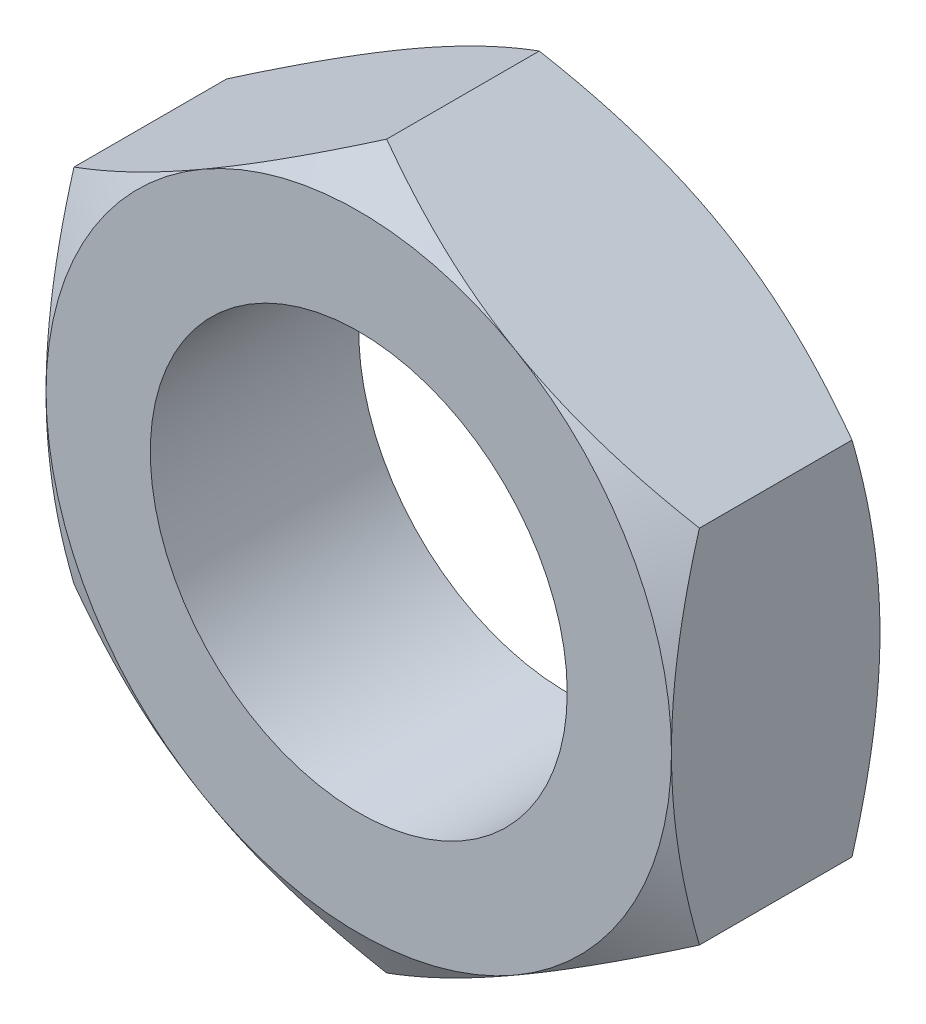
ISO-10303-21;
HEADER;
FILE_DESCRIPTION(('STEP AP214'),'2;1');
FILE_NAME('part.step','',(''),(''),'','','');
FILE_SCHEMA(('AUTOMOTIVE_DESIGN { 1 0 10303 214 1 1 1 1 }'));
ENDSEC;
DATA;
#1=APPLICATION_CONTEXT('core data for automotive mechanical design processes');
#2=APPLICATION_PROTOCOL_DEFINITION('international standard','automotive_design',2000,#1);
#3=PRODUCT_CONTEXT('',#1,'mechanical');
#4=PRODUCT('Part','Part','',(#3));
#5=PRODUCT_RELATED_PRODUCT_CATEGORY('part','',(#4));
#6=PRODUCT_DEFINITION_FORMATION('','',#4);
#7=PRODUCT_DEFINITION_CONTEXT('part definition',#1,'design');
#8=PRODUCT_DEFINITION('design','',#6,#7);
#9=PRODUCT_DEFINITION_SHAPE('','',#8);
#10=(LENGTH_UNIT() NAMED_UNIT(*) SI_UNIT(.MILLI.,.METRE.));
#11=(NAMED_UNIT(*) PLANE_ANGLE_UNIT() SI_UNIT($,.RADIAN.));
#12=(NAMED_UNIT(*) SI_UNIT($,.STERADIAN.) SOLID_ANGLE_UNIT());
#13=UNCERTAINTY_MEASURE_WITH_UNIT(LENGTH_MEASURE(1.E-05),#10,'distance_accuracy_value','');
#14=(GEOMETRIC_REPRESENTATION_CONTEXT(3) GLOBAL_UNCERTAINTY_ASSIGNED_CONTEXT((#13)) GLOBAL_UNIT_ASSIGNED_CONTEXT((#10,
#11,#12)) REPRESENTATION_CONTEXT('',''));
#15=CARTESIAN_POINT('',(0.,0.,0.));
#16=DIRECTION('',(0.,0.,1.));
#17=DIRECTION('',(1.,0.,0.));
#18=AXIS2_PLACEMENT_3D('',#15,#16,#17);
#19=CARTESIAN_POINT('',(-10.5,18.1865334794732,0.));
#20=DIRECTION('',(0.,0.,-1.));
#21=DIRECTION('',(-1.,0.,0.));
#22=AXIS2_PLACEMENT_3D('',#19,#20,#21);
#23=PLANE('',#22);
#24=CARTESIAN_POINT('',(0.,0.,0.));
#25=DIRECTION('',(0.,0.,1.));
#26=DIRECTION('',(1.,0.,0.));
#27=AXIS2_PLACEMENT_3D('',#24,#25,#26);
#28=CIRCLE('',#27,7.);
#29=CARTESIAN_POINT('',(7.,0.,0.));
#30=VERTEX_POINT('',#29);
#31=EDGE_CURVE('E320',#30,#30,#28,.T.);
#32=ORIENTED_EDGE('',*,*,#31,.F.);
#33=EDGE_LOOP('',(#32));
#34=FACE_BOUND('',#33,.T.);
#35=CARTESIAN_POINT('',(0.,0.,0.));
#36=DIRECTION('',(0.,0.,-1.));
#37=DIRECTION('',(-1.,0.,0.));
#38=AXIS2_PLACEMENT_3D('',#35,#36,#37);
#39=CIRCLE('',#38,10.5);
#40=CARTESIAN_POINT('',(-10.5,0.,0.));
#41=VERTEX_POINT('',#40);
#42=CARTESIAN_POINT('',(-5.25,9.09326673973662,0.));
#43=VERTEX_POINT('',#42);
#44=EDGE_CURVE('E328',#41,#43,#39,.T.);
#45=ORIENTED_EDGE('',*,*,#44,.F.);
#46=CARTESIAN_POINT('',(0.,0.,0.));
#47=DIRECTION('',(0.,0.,-1.));
#48=DIRECTION('',(-1.,0.,0.));
#49=AXIS2_PLACEMENT_3D('',#46,#47,#48);
#50=CIRCLE('',#49,10.5);
#51=CARTESIAN_POINT('',(-5.24999999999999,-9.09326673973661,0.));
#52=VERTEX_POINT('',#51);
#53=EDGE_CURVE('E151',#41,#52,#50,.F.);
#54=ORIENTED_EDGE('',*,*,#53,.T.);
#55=CARTESIAN_POINT('',(5.24999999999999,-9.09326673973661,0.));
#56=VERTEX_POINT('',#55);
#57=EDGE_CURVE('E252',#52,#56,#50,.F.);
#58=ORIENTED_EDGE('',*,*,#57,.T.);
#59=CARTESIAN_POINT('',(10.5,0.,0.));
#60=VERTEX_POINT('',#59);
#61=EDGE_CURVE('E154',#56,#60,#50,.F.);
#62=ORIENTED_EDGE('',*,*,#61,.T.);
#63=CARTESIAN_POINT('',(5.24999999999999,9.09326673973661,0.));
#64=VERTEX_POINT('',#63);
#65=EDGE_CURVE('E129',#60,#64,#50,.F.);
#66=ORIENTED_EDGE('',*,*,#65,.T.);
#67=EDGE_CURVE('E142',#64,#43,#50,.F.);
#68=ORIENTED_EDGE('',*,*,#67,.T.);
#69=EDGE_LOOP('',(#45,#54,#58,#62,#66,#68));
#70=FACE_BOUND('',#69,.T.);
#71=ADVANCED_FACE('F34',(#34,#70),#23,.F.);
#72=CARTESIAN_POINT('',(0.,0.,0.));
#73=DIRECTION('',(0.,0.,-1.));
#74=DIRECTION('',(-1.,0.,0.));
#75=AXIS2_PLACEMENT_3D('',#72,#73,#74);
#76=CONICAL_SURFACE('',#75,10.5,1.0471975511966);
#77=CARTESIAN_POINT('',(-10.5,-16.4358944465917,-5.19820443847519));
#78=CARTESIAN_POINT('',(-10.5,-16.2059572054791,-5.08633284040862));
#79=CARTESIAN_POINT('',(-10.5,-15.9757542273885,-4.97500768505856));
#80=CARTESIAN_POINT('',(-10.5,-15.5147613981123,-4.75357372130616));
#81=CARTESIAN_POINT('',(-10.5,-15.2839715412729,-4.64346492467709));
#82=CARTESIAN_POINT('',(-10.5,-14.5905791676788,-4.31512021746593));
#83=CARTESIAN_POINT('',(-10.5,-14.1270195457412,-4.0988980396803));
#84=CARTESIAN_POINT('',(-10.5,-13.1943979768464,-3.67197063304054));
#85=CARTESIAN_POINT('',(-10.5,-12.7253199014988,-3.46130055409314));
#86=CARTESIAN_POINT('',(-10.5,-11.7834863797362,-3.04837704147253));
#87=CARTESIAN_POINT('',(-10.5,-11.3107311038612,-2.84612322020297));
#88=CARTESIAN_POINT('',(-10.5,-10.3449331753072,-2.44567902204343));
#89=CARTESIAN_POINT('',(-10.5,-9.85174008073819,-2.24784963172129));
#90=CARTESIAN_POINT('',(-10.5,-8.85963681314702,-1.86679740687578));
#91=CARTESIAN_POINT('',(-10.5,-8.36072601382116,-1.68357619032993));
#92=CARTESIAN_POINT('',(-10.5,-7.35729528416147,-1.33644217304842));
#93=CARTESIAN_POINT('',(-10.5,-6.85278853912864,-1.1724915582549));
#94=CARTESIAN_POINT('',(-10.5,-5.83649208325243,-0.869048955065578));
#95=CARTESIAN_POINT('',(-10.5,-5.32470467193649,-0.729549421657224));
#96=CARTESIAN_POINT('',(-10.5,-4.55289136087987,-0.543995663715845));
#97=CARTESIAN_POINT('',(-10.5,-4.29566635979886,-0.486224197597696));
#98=CARTESIAN_POINT('',(-10.5,-3.77943107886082,-0.379252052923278));
#99=CARTESIAN_POINT('',(-10.5,-3.52042083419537,-0.330051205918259));
#100=CARTESIAN_POINT('',(-10.5,-3.00078262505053,-0.241079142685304));
#101=CARTESIAN_POINT('',(-10.5,-2.74015469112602,-0.201307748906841));
#102=CARTESIAN_POINT('',(-10.5,-2.21754460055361,-0.131981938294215));
#103=CARTESIAN_POINT('',(-10.5,-1.95556249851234,-0.102427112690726));
#104=CARTESIAN_POINT('',(-10.5,-1.4340966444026,-0.0545007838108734));
#105=CARTESIAN_POINT('',(-10.5,-1.1746262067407,-0.0359853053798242));
#106=CARTESIAN_POINT('',(-10.5,-0.655134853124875,-0.00995108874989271));
#107=CARTESIAN_POINT('',(-10.5,-0.39511394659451,-0.00243216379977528));
#108=CARTESIAN_POINT('',(-10.5,0.12501291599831,0.00142934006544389));
#109=CARTESIAN_POINT('',(-10.5,0.385118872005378,-0.00222807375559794));
#110=CARTESIAN_POINT('',(-10.5,0.904941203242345,-0.0206279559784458));
#111=CARTESIAN_POINT('',(-10.5,1.16465755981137,-0.0353709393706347));
#112=CARTESIAN_POINT('',(-10.5,1.7842910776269,-0.0834532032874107));
#113=CARTESIAN_POINT('',(-10.5,2.14382833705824,-0.121799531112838));
#114=CARTESIAN_POINT('',(-10.5,2.86031645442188,-0.217678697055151));
#115=CARTESIAN_POINT('',(-10.5,3.21726697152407,-0.27521401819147));
#116=CARTESIAN_POINT('',(-10.5,4.28378552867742,-0.473559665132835));
#117=CARTESIAN_POINT('',(-10.5,4.98864074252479,-0.640076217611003));
#118=CARTESIAN_POINT('',(-10.5,6.04276689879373,-0.929878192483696));
#119=CARTESIAN_POINT('',(-10.5,6.39747786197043,-1.03452367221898));
#120=CARTESIAN_POINT('',(-10.5,7.10345747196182,-1.25494800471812));
#121=CARTESIAN_POINT('',(-10.5,7.45472609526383,-1.37072693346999));
#122=CARTESIAN_POINT('',(-10.5,8.1539260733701,-1.61153872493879));
#123=CARTESIAN_POINT('',(-10.5,8.50185842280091,-1.73656872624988));
#124=CARTESIAN_POINT('',(-10.5,9.19482306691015,-1.99438530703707));
#125=CARTESIAN_POINT('',(-10.5,9.53985540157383,-2.12717177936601));
#126=CARTESIAN_POINT('',(-10.5,10.376454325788,-2.45822492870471));
#127=CARTESIAN_POINT('',(-10.5,10.8666655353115,-2.6599111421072));
#128=CARTESIAN_POINT('',(-10.5,11.8427074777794,-3.07365042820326));
#129=CARTESIAN_POINT('',(-10.5,12.3285378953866,-3.28570424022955));
#130=CARTESIAN_POINT('',(-10.5,13.2966698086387,-3.7180282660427));
#131=CARTESIAN_POINT('',(-10.5,13.7789703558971,-3.93830059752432));
#132=CARTESIAN_POINT('',(-10.5,14.7405285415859,-4.38534134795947));
#133=CARTESIAN_POINT('',(-10.5,15.2197862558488,-4.61210960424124));
#134=CARTESIAN_POINT('',(-10.5,16.1763649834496,-5.07116576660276));
#135=CARTESIAN_POINT('',(-10.5,16.6536829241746,-5.30346006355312));
#136=CARTESIAN_POINT('',(-10.5,17.6062110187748,-5.77233035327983));
#137=CARTESIAN_POINT('',(-10.5,18.0814211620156,-6.00890636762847));
#138=CARTESIAN_POINT('',(-10.5,19.0299973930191,-6.48554777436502));
#139=CARTESIAN_POINT('',(-10.5,19.5033637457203,-6.72561264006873));
#140=CARTESIAN_POINT('',(-10.5,20.4485969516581,-7.20867815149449));
#141=CARTESIAN_POINT('',(-10.5,20.92046379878,-7.45167880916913));
#142=CARTESIAN_POINT('',(-10.5,22.2507580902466,-8.14113674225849));
#143=CARTESIAN_POINT('',(-10.5,23.1077085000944,-8.59044374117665));
#144=CARTESIAN_POINT('',(-10.5,24.8184449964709,-9.49511172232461));
#145=CARTESIAN_POINT('',(-10.5,25.6722309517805,-9.95047295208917));
#146=CARTESIAN_POINT('',(-10.5,27.3750010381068,-10.8645542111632));
#147=CARTESIAN_POINT('',(-10.5,28.223991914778,-11.3232616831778));
#148=CARTESIAN_POINT('',(-10.5,29.4959967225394,-12.0139868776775));
#149=CARTESIAN_POINT('',(-10.5,29.9197387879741,-12.2446656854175));
#150=CARTESIAN_POINT('',(-10.5,30.7667866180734,-12.706821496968));
#151=CARTESIAN_POINT('',(-10.5,31.1900923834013,-12.9382984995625));
#152=CARTESIAN_POINT('',(-10.5,31.6132051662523,-13.1701278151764));
#153=B_SPLINE_CURVE_WITH_KNOTS('',3,(#77,#78,#79,#80,#81,#82,#83,#84,#85,#86,#87,#88,#89,#90,
#91,#92,#93,#94,#95,#96,#97,#98,#99,#100,#101,#102,#103,#104,#105,#106,#107,#108,#109,#110,#111,
#112,#113,#114,#115,#116,#117,#118,#119,#120,#121,#122,#123,#124,#125,#126,#127,#128,#129,#130,
#131,#132,#133,#134,#135,#136,#137,#138,#139,#140,#141,#142,#143,#144,#145,#146,#147,#148,#149,
#150,#151,#152),.UNSPECIFIED.,.F.,.F.,(4,2,2,2,2,2,2,2,2,2,2,2,2,2,2,2,2,2,2,2,2,2,2,2,2,2,2,2,
2,2,2,2,2,2,2,2,2,4),(0.,0.767121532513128,1.53425048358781,3.06872766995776,4.61130541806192,
6.15381204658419,7.74780690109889,9.34197805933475,10.9329668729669,12.5234638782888,
13.3142425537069,14.1050056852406,14.8957539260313,15.686470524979,16.4666352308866,
17.2467866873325,18.0269376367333,18.8071248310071,19.8912444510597,20.9755044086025,
23.1451630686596,24.2545416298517,25.3639277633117,26.4729721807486,27.5820012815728,
29.1720757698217,30.7622638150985,32.3528644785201,33.9434253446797,35.5359249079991,
37.1284324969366,38.7207021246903,40.312978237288,43.215727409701,46.1185956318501,
49.013541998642,50.4609288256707,51.9083134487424),.UNSPECIFIED.);
#154=CARTESIAN_POINT('',(-10.5,6.06217782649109,-0.937822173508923));
#155=VERTEX_POINT('',#154);
#156=EDGE_CURVE('E159',#155,#41,#153,.F.);
#157=ORIENTED_EDGE('',*,*,#156,.T.);
#158=ORIENTED_EDGE('',*,*,#44,.T.);
#159=CARTESIAN_POINT('',(0.000200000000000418,12.124471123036,-0.937888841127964));
#160=CARTESIAN_POINT('',(-0.230612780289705,11.9912113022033,-0.86096391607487));
#161=CARTESIAN_POINT('',(-0.462286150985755,11.8574546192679,-0.787530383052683));
#162=CARTESIAN_POINT('',(-0.927490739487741,11.588868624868,-0.648614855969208));
#163=CARTESIAN_POINT('',(-1.16102254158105,11.4540389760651,-0.583135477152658));
#164=CARTESIAN_POINT('',(-1.86538084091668,11.0473775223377,-0.399895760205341));
#165=CARTESIAN_POINT('',(-2.33898788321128,10.7739403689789,-0.295669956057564));
#166=CARTESIAN_POINT('',(-3.04771913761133,10.3647541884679,-0.173455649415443));
#167=CARTESIAN_POINT('',(-3.28072597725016,10.2302276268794,-0.138641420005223));
#168=CARTESIAN_POINT('',(-3.74781845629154,9.96055165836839,-0.0802602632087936));
#169=CARTESIAN_POINT('',(-3.98190411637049,9.82540223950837,-0.0566935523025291));
#170=CARTESIAN_POINT('',(-4.45046590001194,9.55487796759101,-0.0214112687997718));
#171=CARTESIAN_POINT('',(-4.68494122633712,9.41950357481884,-0.00968161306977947));
#172=CARTESIAN_POINT('',(-5.15410845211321,9.14862975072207,0.0016773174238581));
#173=CARTESIAN_POINT('',(-5.38880034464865,9.01313032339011,0.00130696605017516));
#174=CARTESIAN_POINT('',(-5.82756124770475,8.75981159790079,-0.0106922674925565));
#175=CARTESIAN_POINT('',(-6.03166122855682,8.64197441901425,-0.0208573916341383));
#176=CARTESIAN_POINT('',(-6.43938384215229,8.40657565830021,-0.0501416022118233));
#177=CARTESIAN_POINT('',(-6.64300644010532,8.28901409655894,-0.0692613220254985));
#178=CARTESIAN_POINT('',(-7.25308524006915,7.93678493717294,-0.139600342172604));
#179=CARTESIAN_POINT('',(-7.65846156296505,7.70274080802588,-0.203790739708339));
#180=CARTESIAN_POINT('',(-8.47351422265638,7.23216993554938,-0.364267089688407));
#181=CARTESIAN_POINT('',(-8.88308654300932,6.99570324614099,-0.461233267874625));
#182=CARTESIAN_POINT('',(-9.69612354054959,6.52629611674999,-0.681306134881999));
#183=CARTESIAN_POINT('',(-10.0995986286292,6.29334966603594,-0.80436113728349));
#184=CARTESIAN_POINT('',(-10.5002,6.06206235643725,-0.937888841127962));
#185=B_SPLINE_CURVE_WITH_KNOTS('',3,(#159,#160,#161,#162,#163,#164,#165,#166,#167,#168,#169,
#170,#171,#172,#173,#174,#175,#176,#177,#178,#179,#180,#181,#182,#183,#184),.UNSPECIFIED.,.F.,
.F.,(4,2,2,2,2,2,2,2,2,2,2,2,4),(0.,0.832130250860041,1.66453336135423,3.33288308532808,
4.14658222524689,4.9602970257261,5.77304256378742,6.58576298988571,7.29326708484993,
8.00082123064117,9.41693497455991,10.864454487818,12.3091325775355),.UNSPECIFIED.);
#186=EDGE_CURVE('E191',#43,#155,#185,.T.);
#187=ORIENTED_EDGE('',*,*,#186,.T.);
#188=EDGE_LOOP('',(#157,#158,#187));
#189=FACE_BOUND('',#188,.T.);
#190=ADVANCED_FACE('F178',(#189),#76,.T.);
#191=CARTESIAN_POINT('',(10.5002,6.06206235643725,-0.937888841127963));
#192=CARTESIAN_POINT('',(10.2693872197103,6.19532217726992,-0.860963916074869));
#193=CARTESIAN_POINT('',(10.0377138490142,6.32907886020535,-0.787530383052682));
#194=CARTESIAN_POINT('',(9.57250926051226,6.59766485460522,-0.648614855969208));
#195=CARTESIAN_POINT('',(9.33897745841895,6.73249450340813,-0.583135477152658));
#196=CARTESIAN_POINT('',(8.63461915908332,7.13915595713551,-0.399895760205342));
#197=CARTESIAN_POINT('',(8.16101211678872,7.41259311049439,-0.295669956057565));
#198=CARTESIAN_POINT('',(7.45228086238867,7.82177929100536,-0.173455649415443));
#199=CARTESIAN_POINT('',(7.21927402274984,7.95630585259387,-0.138641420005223));
#200=CARTESIAN_POINT('',(6.75218154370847,8.22598182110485,-0.0802602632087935));
#201=CARTESIAN_POINT('',(6.51809588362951,8.36113123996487,-0.0566935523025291));
#202=CARTESIAN_POINT('',(6.04953409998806,8.63165551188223,-0.0214112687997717));
#203=CARTESIAN_POINT('',(5.81505877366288,8.7670299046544,-0.00968161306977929));
#204=CARTESIAN_POINT('',(5.34589154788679,9.03790372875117,0.00167731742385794));
#205=CARTESIAN_POINT('',(5.11119965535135,9.17340315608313,0.00130696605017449));
#206=CARTESIAN_POINT('',(4.67243875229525,9.42672188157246,-0.0106922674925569));
#207=CARTESIAN_POINT('',(4.46833877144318,9.54455906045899,-0.020857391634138));
#208=CARTESIAN_POINT('',(4.06061615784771,9.77995782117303,-0.0501416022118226));
#209=CARTESIAN_POINT('',(3.85699355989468,9.89751938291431,-0.0692613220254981));
#210=CARTESIAN_POINT('',(3.24691475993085,10.2497485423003,-0.139600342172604));
#211=CARTESIAN_POINT('',(2.84153843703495,10.4837926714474,-0.203790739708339));
#212=CARTESIAN_POINT('',(2.02648577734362,10.9543635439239,-0.364267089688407));
#213=CARTESIAN_POINT('',(1.61691345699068,11.1908302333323,-0.461233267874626));
#214=CARTESIAN_POINT('',(0.803876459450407,11.6602373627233,-0.681306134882));
#215=CARTESIAN_POINT('',(0.400401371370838,11.8931838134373,-0.804361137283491));
#216=CARTESIAN_POINT('',(-0.000199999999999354,12.124471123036,-0.937888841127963));
#217=B_SPLINE_CURVE_WITH_KNOTS('',3,(#191,#192,#193,#194,#195,#196,#197,#198,#199,#200,#201,
#202,#203,#204,#205,#206,#207,#208,#209,#210,#211,#212,#213,#214,#215,#216),.UNSPECIFIED.,.F.,
.F.,(4,2,2,2,2,2,2,2,2,2,2,2,4),(0.,0.83213025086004,1.66453336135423,3.33288308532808,
4.14658222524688,4.9602970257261,5.77304256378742,6.58576298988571,7.29326708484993,
8.00082123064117,9.41693497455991,10.864454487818,12.3091325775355),.UNSPECIFIED.);
#218=CARTESIAN_POINT('',(0.,12.1243556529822,-0.937822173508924));
#219=VERTEX_POINT('',#218);
#220=EDGE_CURVE('E138',#64,#219,#217,.T.);
#221=ORIENTED_EDGE('',*,*,#220,.T.);
#222=EDGE_CURVE('E145',#219,#43,#185,.T.);
#223=ORIENTED_EDGE('',*,*,#222,.T.);
#224=ORIENTED_EDGE('',*,*,#67,.F.);
#225=EDGE_LOOP('',(#221,#223,#224));
#226=FACE_BOUND('',#225,.T.);
#227=ADVANCED_FACE('F143',(#226),#76,.T.);
#228=CARTESIAN_POINT('',(10.5,-16.4358944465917,-5.19820443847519));
#229=CARTESIAN_POINT('',(10.5,-16.2059572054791,-5.08633284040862));
#230=CARTESIAN_POINT('',(10.5,-15.9757542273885,-4.97500768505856));
#231=CARTESIAN_POINT('',(10.5,-15.5147613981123,-4.75357372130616));
#232=CARTESIAN_POINT('',(10.5,-15.2839715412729,-4.64346492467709));
#233=CARTESIAN_POINT('',(10.5,-14.5905791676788,-4.31512021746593));
#234=CARTESIAN_POINT('',(10.5,-14.1270195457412,-4.0988980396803));
#235=CARTESIAN_POINT('',(10.5,-13.1943979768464,-3.67197063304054));
#236=CARTESIAN_POINT('',(10.5,-12.7253199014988,-3.46130055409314));
#237=CARTESIAN_POINT('',(10.5,-11.7834863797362,-3.04837704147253));
#238=CARTESIAN_POINT('',(10.5,-11.3107311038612,-2.84612322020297));
#239=CARTESIAN_POINT('',(10.5,-10.3449331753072,-2.44567902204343));
#240=CARTESIAN_POINT('',(10.5,-9.85174008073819,-2.24784963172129));
#241=CARTESIAN_POINT('',(10.5,-8.85963681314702,-1.86679740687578));
#242=CARTESIAN_POINT('',(10.5,-8.36072601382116,-1.68357619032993));
#243=CARTESIAN_POINT('',(10.5,-7.35729528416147,-1.33644217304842));
#244=CARTESIAN_POINT('',(10.5,-6.85278853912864,-1.1724915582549));
#245=CARTESIAN_POINT('',(10.5,-5.83649208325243,-0.869048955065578));
#246=CARTESIAN_POINT('',(10.5,-5.32470467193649,-0.729549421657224));
#247=CARTESIAN_POINT('',(10.5,-4.55289136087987,-0.543995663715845));
#248=CARTESIAN_POINT('',(10.5,-4.29566635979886,-0.486224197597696));
#249=CARTESIAN_POINT('',(10.5,-3.77943107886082,-0.379252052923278));
#250=CARTESIAN_POINT('',(10.5,-3.52042083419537,-0.330051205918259));
#251=CARTESIAN_POINT('',(10.5,-3.00078262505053,-0.241079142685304));
#252=CARTESIAN_POINT('',(10.5,-2.74015469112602,-0.201307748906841));
#253=CARTESIAN_POINT('',(10.5,-2.21754460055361,-0.131981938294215));
#254=CARTESIAN_POINT('',(10.5,-1.95556249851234,-0.102427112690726));
#255=CARTESIAN_POINT('',(10.5,-1.4340966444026,-0.0545007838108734));
#256=CARTESIAN_POINT('',(10.5,-1.1746262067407,-0.0359853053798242));
#257=CARTESIAN_POINT('',(10.5,-0.655134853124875,-0.00995108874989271));
#258=CARTESIAN_POINT('',(10.5,-0.39511394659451,-0.00243216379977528));
#259=CARTESIAN_POINT('',(10.5,0.12501291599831,0.00142934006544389));
#260=CARTESIAN_POINT('',(10.5,0.385118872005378,-0.00222807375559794));
#261=CARTESIAN_POINT('',(10.5,0.904941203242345,-0.0206279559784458));
#262=CARTESIAN_POINT('',(10.5,1.16465755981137,-0.0353709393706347));
#263=CARTESIAN_POINT('',(10.5,1.7842910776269,-0.0834532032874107));
#264=CARTESIAN_POINT('',(10.5,2.14382833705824,-0.121799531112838));
#265=CARTESIAN_POINT('',(10.5,2.86031645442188,-0.217678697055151));
#266=CARTESIAN_POINT('',(10.5,3.21726697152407,-0.27521401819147));
#267=CARTESIAN_POINT('',(10.5,4.28378552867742,-0.473559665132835));
#268=CARTESIAN_POINT('',(10.5,4.98864074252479,-0.640076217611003));
#269=CARTESIAN_POINT('',(10.5,6.04276689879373,-0.929878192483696));
#270=CARTESIAN_POINT('',(10.5,6.39747786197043,-1.03452367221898));
#271=CARTESIAN_POINT('',(10.5,7.10345747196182,-1.25494800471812));
#272=CARTESIAN_POINT('',(10.5,7.45472609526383,-1.37072693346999));
#273=CARTESIAN_POINT('',(10.5,8.1539260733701,-1.61153872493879));
#274=CARTESIAN_POINT('',(10.5,8.50185842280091,-1.73656872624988));
#275=CARTESIAN_POINT('',(10.5,9.19482306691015,-1.99438530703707));
#276=CARTESIAN_POINT('',(10.5,9.53985540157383,-2.12717177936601));
#277=CARTESIAN_POINT('',(10.5,10.376454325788,-2.45822492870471));
#278=CARTESIAN_POINT('',(10.5,10.8666655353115,-2.6599111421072));
#279=CARTESIAN_POINT('',(10.5,11.8427074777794,-3.07365042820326));
#280=CARTESIAN_POINT('',(10.5,12.3285378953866,-3.28570424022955));
#281=CARTESIAN_POINT('',(10.5,13.2966698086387,-3.7180282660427));
#282=CARTESIAN_POINT('',(10.5,13.7789703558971,-3.93830059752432));
#283=CARTESIAN_POINT('',(10.5,14.7405285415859,-4.38534134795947));
#284=CARTESIAN_POINT('',(10.5,15.2197862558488,-4.61210960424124));
#285=CARTESIAN_POINT('',(10.5,16.1763649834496,-5.07116576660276));
#286=CARTESIAN_POINT('',(10.5,16.6536829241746,-5.30346006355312));
#287=CARTESIAN_POINT('',(10.5,17.6062110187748,-5.77233035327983));
#288=CARTESIAN_POINT('',(10.5,18.0814211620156,-6.00890636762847));
#289=CARTESIAN_POINT('',(10.5,19.0299973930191,-6.48554777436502));
#290=CARTESIAN_POINT('',(10.5,19.5033637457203,-6.72561264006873));
#291=CARTESIAN_POINT('',(10.5,20.4485969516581,-7.20867815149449));
#292=CARTESIAN_POINT('',(10.5,20.92046379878,-7.45167880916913));
#293=CARTESIAN_POINT('',(10.5,22.2507580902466,-8.14113674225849));
#294=CARTESIAN_POINT('',(10.5,23.1077085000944,-8.59044374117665));
#295=CARTESIAN_POINT('',(10.5,24.8184449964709,-9.49511172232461));
#296=CARTESIAN_POINT('',(10.5,25.6722309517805,-9.95047295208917));
#297=CARTESIAN_POINT('',(10.5,27.3750010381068,-10.8645542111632));
#298=CARTESIAN_POINT('',(10.5,28.223991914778,-11.3232616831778));
#299=CARTESIAN_POINT('',(10.5,29.4959967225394,-12.0139868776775));
#300=CARTESIAN_POINT('',(10.5,29.9197387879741,-12.2446656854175));
#301=CARTESIAN_POINT('',(10.5,30.7667866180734,-12.706821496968));
#302=CARTESIAN_POINT('',(10.5,31.1900923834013,-12.9382984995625));
#303=CARTESIAN_POINT('',(10.5,31.6132051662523,-13.1701278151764));
#304=B_SPLINE_CURVE_WITH_KNOTS('',3,(#228,#229,#230,#231,#232,#233,#234,#235,#236,#237,#238,
#239,#240,#241,#242,#243,#244,#245,#246,#247,#248,#249,#250,#251,#252,#253,#254,#255,#256,#257,
#258,#259,#260,#261,#262,#263,#264,#265,#266,#267,#268,#269,#270,#271,#272,#273,#274,#275,#276,
#277,#278,#279,#280,#281,#282,#283,#284,#285,#286,#287,#288,#289,#290,#291,#292,#293,#294,#295,
#296,#297,#298,#299,#300,#301,#302,#303),.UNSPECIFIED.,.F.,.F.,(4,2,2,2,2,2,2,2,2,2,2,2,2,2,2,2,
2,2,2,2,2,2,2,2,2,2,2,2,2,2,2,2,2,2,2,2,2,4),(0.,0.767121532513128,1.53425048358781,
3.06872766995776,4.61130541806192,6.15381204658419,7.74780690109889,9.34197805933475,
10.9329668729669,12.5234638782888,13.3142425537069,14.1050056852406,14.8957539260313,
15.686470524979,16.4666352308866,17.2467866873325,18.0269376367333,18.8071248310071,
19.8912444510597,20.9755044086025,23.1451630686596,24.2545416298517,25.3639277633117,
26.4729721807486,27.5820012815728,29.1720757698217,30.7622638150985,32.3528644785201,
33.9434253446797,35.5359249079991,37.1284324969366,38.7207021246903,40.312978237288,
43.215727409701,46.1185956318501,49.013541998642,50.4609288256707,51.9083134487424),.UNSPECIFIED.);
#305=CARTESIAN_POINT('',(10.5,6.06217782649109,-0.937822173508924));
#306=VERTEX_POINT('',#305);
#307=EDGE_CURVE('E132',#60,#306,#304,.T.);
#308=ORIENTED_EDGE('',*,*,#307,.T.);
#309=EDGE_CURVE('E125',#306,#64,#217,.T.);
#310=ORIENTED_EDGE('',*,*,#309,.T.);
#311=ORIENTED_EDGE('',*,*,#65,.F.);
#312=EDGE_LOOP('',(#308,#310,#311));
#313=FACE_BOUND('',#312,.T.);
#314=ADVANCED_FACE('F127',(#313),#76,.T.);
#315=CARTESIAN_POINT('',(-0.000200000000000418,-12.124471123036,-0.937888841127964));
#316=CARTESIAN_POINT('',(0.230612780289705,-11.9912113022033,-0.86096391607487));
#317=CARTESIAN_POINT('',(0.462286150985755,-11.8574546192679,-0.787530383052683));
#318=CARTESIAN_POINT('',(0.927490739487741,-11.588868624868,-0.648614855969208));
#319=CARTESIAN_POINT('',(1.16102254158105,-11.4540389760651,-0.583135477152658));
#320=CARTESIAN_POINT('',(1.86538084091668,-11.0473775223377,-0.399895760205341));
#321=CARTESIAN_POINT('',(2.33898788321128,-10.7739403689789,-0.295669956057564));
#322=CARTESIAN_POINT('',(3.04771913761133,-10.3647541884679,-0.173455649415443));
#323=CARTESIAN_POINT('',(3.28072597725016,-10.2302276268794,-0.138641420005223));
#324=CARTESIAN_POINT('',(3.74781845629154,-9.96055165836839,-0.0802602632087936));
#325=CARTESIAN_POINT('',(3.98190411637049,-9.82540223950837,-0.0566935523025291));
#326=CARTESIAN_POINT('',(4.45046590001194,-9.55487796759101,-0.0214112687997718));
#327=CARTESIAN_POINT('',(4.68494122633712,-9.41950357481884,-0.00968161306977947));
#328=CARTESIAN_POINT('',(5.15410845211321,-9.14862975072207,0.0016773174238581));
#329=CARTESIAN_POINT('',(5.38880034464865,-9.01313032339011,0.00130696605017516));
#330=CARTESIAN_POINT('',(5.82756124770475,-8.75981159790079,-0.0106922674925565));
#331=CARTESIAN_POINT('',(6.03166122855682,-8.64197441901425,-0.0208573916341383));
#332=CARTESIAN_POINT('',(6.43938384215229,-8.40657565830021,-0.0501416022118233));
#333=CARTESIAN_POINT('',(6.64300644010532,-8.28901409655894,-0.0692613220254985));
#334=CARTESIAN_POINT('',(7.25308524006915,-7.93678493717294,-0.139600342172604));
#335=CARTESIAN_POINT('',(7.65846156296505,-7.70274080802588,-0.203790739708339));
#336=CARTESIAN_POINT('',(8.47351422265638,-7.23216993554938,-0.364267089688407));
#337=CARTESIAN_POINT('',(8.88308654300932,-6.99570324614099,-0.461233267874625));
#338=CARTESIAN_POINT('',(9.69612354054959,-6.52629611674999,-0.681306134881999));
#339=CARTESIAN_POINT('',(10.0995986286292,-6.29334966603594,-0.80436113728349));
#340=CARTESIAN_POINT('',(10.5002,-6.06206235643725,-0.937888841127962));
#341=B_SPLINE_CURVE_WITH_KNOTS('',3,(#315,#316,#317,#318,#319,#320,#321,#322,#323,#324,#325,
#326,#327,#328,#329,#330,#331,#332,#333,#334,#335,#336,#337,#338,#339,#340),.UNSPECIFIED.,.F.,
.F.,(4,2,2,2,2,2,2,2,2,2,2,2,4),(0.,0.832130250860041,1.66453336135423,3.33288308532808,
4.14658222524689,4.9602970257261,5.77304256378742,6.58576298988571,7.29326708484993,
8.00082123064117,9.41693497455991,10.864454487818,12.3091325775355),.UNSPECIFIED.);
#342=CARTESIAN_POINT('',(10.5,-6.06217782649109,-0.937822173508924));
#343=VERTEX_POINT('',#342);
#344=EDGE_CURVE('E205',#56,#343,#341,.T.);
#345=ORIENTED_EDGE('',*,*,#344,.T.);
#346=EDGE_CURVE('E204',#343,#60,#304,.T.);
#347=ORIENTED_EDGE('',*,*,#346,.T.);
#348=ORIENTED_EDGE('',*,*,#61,.F.);
#349=EDGE_LOOP('',(#345,#347,#348));
#350=FACE_BOUND('',#349,.T.);
#351=ADVANCED_FACE('F429',(#350),#76,.T.);
#352=CARTESIAN_POINT('',(0.,-12.1243556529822,-0.937822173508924));
#353=VERTEX_POINT('',#352);
#354=EDGE_CURVE('E262',#353,#56,#341,.T.);
#355=ORIENTED_EDGE('',*,*,#354,.T.);
#356=ORIENTED_EDGE('',*,*,#57,.F.);
#357=CARTESIAN_POINT('',(-10.5002,-6.06206235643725,-0.937888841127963));
#358=CARTESIAN_POINT('',(-10.2693872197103,-6.19532217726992,-0.860963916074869));
#359=CARTESIAN_POINT('',(-10.0377138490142,-6.32907886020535,-0.787530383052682));
#360=CARTESIAN_POINT('',(-9.57250926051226,-6.59766485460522,-0.648614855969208));
#361=CARTESIAN_POINT('',(-9.33897745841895,-6.73249450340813,-0.583135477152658));
#362=CARTESIAN_POINT('',(-8.63461915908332,-7.13915595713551,-0.399895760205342));
#363=CARTESIAN_POINT('',(-8.16101211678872,-7.41259311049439,-0.295669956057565));
#364=CARTESIAN_POINT('',(-7.45228086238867,-7.82177929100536,-0.173455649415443));
#365=CARTESIAN_POINT('',(-7.21927402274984,-7.95630585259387,-0.138641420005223));
#366=CARTESIAN_POINT('',(-6.75218154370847,-8.22598182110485,-0.0802602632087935));
#367=CARTESIAN_POINT('',(-6.51809588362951,-8.36113123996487,-0.0566935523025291));
#368=CARTESIAN_POINT('',(-6.04953409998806,-8.63165551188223,-0.0214112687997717));
#369=CARTESIAN_POINT('',(-5.81505877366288,-8.7670299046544,-0.00968161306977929));
#370=CARTESIAN_POINT('',(-5.34589154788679,-9.03790372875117,0.00167731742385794));
#371=CARTESIAN_POINT('',(-5.11119965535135,-9.17340315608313,0.00130696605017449));
#372=CARTESIAN_POINT('',(-4.67243875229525,-9.42672188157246,-0.0106922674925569));
#373=CARTESIAN_POINT('',(-4.46833877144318,-9.54455906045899,-0.020857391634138));
#374=CARTESIAN_POINT('',(-4.06061615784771,-9.77995782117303,-0.0501416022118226));
#375=CARTESIAN_POINT('',(-3.85699355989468,-9.89751938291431,-0.0692613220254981));
#376=CARTESIAN_POINT('',(-3.24691475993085,-10.2497485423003,-0.139600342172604));
#377=CARTESIAN_POINT('',(-2.84153843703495,-10.4837926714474,-0.203790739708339));
#378=CARTESIAN_POINT('',(-2.02648577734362,-10.9543635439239,-0.364267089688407));
#379=CARTESIAN_POINT('',(-1.61691345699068,-11.1908302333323,-0.461233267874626));
#380=CARTESIAN_POINT('',(-0.803876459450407,-11.6602373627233,-0.681306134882));
#381=CARTESIAN_POINT('',(-0.400401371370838,-11.8931838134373,-0.804361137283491));
#382=CARTESIAN_POINT('',(0.000199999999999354,-12.124471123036,-0.937888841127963));
#383=B_SPLINE_CURVE_WITH_KNOTS('',3,(#357,#358,#359,#360,#361,#362,#363,#364,#365,#366,#367,
#368,#369,#370,#371,#372,#373,#374,#375,#376,#377,#378,#379,#380,#381,#382),.UNSPECIFIED.,.F.,
.F.,(4,2,2,2,2,2,2,2,2,2,2,2,4),(0.,0.83213025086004,1.66453336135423,3.33288308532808,
4.14658222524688,4.9602970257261,5.77304256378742,6.58576298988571,7.29326708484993,
8.00082123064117,9.41693497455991,10.864454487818,12.3091325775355),.UNSPECIFIED.);
#384=EDGE_CURVE('E266',#52,#353,#383,.T.);
#385=ORIENTED_EDGE('',*,*,#384,.T.);
#386=EDGE_LOOP('',(#355,#356,#385));
#387=FACE_BOUND('',#386,.T.);
#388=ADVANCED_FACE('F184',(#387),#76,.T.);
#389=CARTESIAN_POINT('',(-10.5,-6.06217782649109,-0.937822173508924));
#390=VERTEX_POINT('',#389);
#391=EDGE_CURVE('E172',#390,#52,#383,.T.);
#392=ORIENTED_EDGE('',*,*,#391,.T.);
#393=ORIENTED_EDGE('',*,*,#53,.F.);
#394=EDGE_CURVE('E137',#41,#390,#153,.F.);
#395=ORIENTED_EDGE('',*,*,#394,.T.);
#396=EDGE_LOOP('',(#392,#393,#395));
#397=FACE_BOUND('',#396,.T.);
#398=ADVANCED_FACE('F271',(#397),#76,.T.);
#399=CARTESIAN_POINT('',(10.5,6.06217782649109,-7.));
#400=DIRECTION('',(0.499999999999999,0.866025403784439,0.));
#401=DIRECTION('',(-0.866025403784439,0.5,0.));
#402=AXIS2_PLACEMENT_3D('',#399,#400,#401);
#403=PLANE('',#402);
#404=CARTESIAN_POINT('',(-0.000200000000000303,12.124471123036,-6.06211115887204));
#405=CARTESIAN_POINT('',(0.230612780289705,11.9912113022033,-6.13903608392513));
#406=CARTESIAN_POINT('',(0.462286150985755,11.8574546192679,-6.21246961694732));
#407=CARTESIAN_POINT('',(0.927490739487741,11.588868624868,-6.35138514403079));
#408=CARTESIAN_POINT('',(1.16102254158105,11.4540389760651,-6.41686452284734));
#409=CARTESIAN_POINT('',(1.86538084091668,11.0473775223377,-6.60010423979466));
#410=CARTESIAN_POINT('',(2.33898788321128,10.7739403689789,-6.70433004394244));
#411=CARTESIAN_POINT('',(3.04771913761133,10.3647541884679,-6.82654435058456));
#412=CARTESIAN_POINT('',(3.28072597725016,10.2302276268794,-6.86135857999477));
#413=CARTESIAN_POINT('',(3.74781845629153,9.96055165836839,-6.9197397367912));
#414=CARTESIAN_POINT('',(3.98190411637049,9.82540223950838,-6.94330644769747));
#415=CARTESIAN_POINT('',(4.45046590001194,9.55487796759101,-6.97858873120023));
#416=CARTESIAN_POINT('',(4.68494122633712,9.41950357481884,-6.99031838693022));
#417=CARTESIAN_POINT('',(5.15410845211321,9.14862975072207,-7.00167731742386));
#418=CARTESIAN_POINT('',(5.38880034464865,9.01313032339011,-7.00130696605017));
#419=CARTESIAN_POINT('',(5.82756124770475,8.75981159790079,-6.98930773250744));
#420=CARTESIAN_POINT('',(6.03166122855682,8.64197441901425,-6.97914260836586));
#421=CARTESIAN_POINT('',(6.43938384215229,8.40657565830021,-6.94985839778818));
#422=CARTESIAN_POINT('',(6.64300644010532,8.28901409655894,-6.9307386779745));
#423=CARTESIAN_POINT('',(7.25308524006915,7.93678493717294,-6.8603996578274));
#424=CARTESIAN_POINT('',(7.65846156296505,7.70274080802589,-6.79620926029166));
#425=CARTESIAN_POINT('',(8.47351422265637,7.23216993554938,-6.63573291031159));
#426=CARTESIAN_POINT('',(8.88308654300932,6.99570324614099,-6.53876673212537));
#427=CARTESIAN_POINT('',(9.69612354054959,6.52629611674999,-6.318693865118));
#428=CARTESIAN_POINT('',(10.0995986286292,6.29334966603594,-6.19563886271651));
#429=CARTESIAN_POINT('',(10.5002,6.06206235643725,-6.06211115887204));
#430=B_SPLINE_CURVE_WITH_KNOTS('',3,(#404,#405,#406,#407,#408,#409,#410,#411,#412,#413,#414,
#415,#416,#417,#418,#419,#420,#421,#422,#423,#424,#425,#426,#427,#428,#429),.UNSPECIFIED.,.F.,
.F.,(4,2,2,2,2,2,2,2,2,2,2,2,4),(0.,0.832130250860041,1.66453336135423,3.33288308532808,
4.14658222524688,4.9602970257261,5.77304256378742,6.58576298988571,7.29326708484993,
8.00082123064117,9.4169349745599,10.864454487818,12.3091325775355),.UNSPECIFIED.);
#431=CARTESIAN_POINT('',(0.,12.1243556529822,-6.06217782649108));
#432=VERTEX_POINT('',#431);
#433=CARTESIAN_POINT('',(5.24999999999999,9.09326673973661,-7.));
#434=VERTEX_POINT('',#433);
#435=EDGE_CURVE('E237',#432,#434,#430,.T.);
#436=ORIENTED_EDGE('',*,*,#435,.F.);
#437=DIRECTION('',(0.,0.,1.));
#438=VECTOR('',#437,1.);
#439=CARTESIAN_POINT('',(0.,12.1243556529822,-7.));
#440=LINE('',#439,#438);
#441=EDGE_CURVE('E158',#432,#219,#440,.T.);
#442=ORIENTED_EDGE('',*,*,#441,.T.);
#443=ORIENTED_EDGE('',*,*,#220,.F.);
#444=ORIENTED_EDGE('',*,*,#309,.F.);
#445=DIRECTION('',(0.,0.,1.));
#446=VECTOR('',#445,1.);
#447=CARTESIAN_POINT('',(10.5,6.06217782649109,-7.));
#448=LINE('',#447,#446);
#449=CARTESIAN_POINT('',(10.5,6.06217782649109,-6.06217782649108));
#450=VERTEX_POINT('',#449);
#451=EDGE_CURVE('E150',#450,#306,#448,.T.);
#452=ORIENTED_EDGE('',*,*,#451,.F.);
#453=EDGE_CURVE('E232',#434,#450,#430,.T.);
#454=ORIENTED_EDGE('',*,*,#453,.F.);
#455=EDGE_LOOP('',(#436,#442,#443,#444,#452,#454));
#456=FACE_BOUND('',#455,.T.);
#457=ADVANCED_FACE('F36',(#456),#403,.T.);
#458=CARTESIAN_POINT('',(10.5,-6.06217782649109,-7.));
#459=DIRECTION('',(1.,0.,0.));
#460=DIRECTION('',(0.,0.,-1.));
#461=AXIS2_PLACEMENT_3D('',#458,#459,#460);
#462=PLANE('',#461);
#463=CARTESIAN_POINT('',(10.5,-16.4358944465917,-1.80179556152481));
#464=CARTESIAN_POINT('',(10.5,-16.2059572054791,-1.91366715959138));
#465=CARTESIAN_POINT('',(10.5,-15.9757542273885,-2.02499231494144));
#466=CARTESIAN_POINT('',(10.5,-15.5147613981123,-2.24642627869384));
#467=CARTESIAN_POINT('',(10.5,-15.2839715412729,-2.35653507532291));
#468=CARTESIAN_POINT('',(10.5,-14.5905791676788,-2.68487978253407));
#469=CARTESIAN_POINT('',(10.5,-14.1270195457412,-2.9011019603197));
#470=CARTESIAN_POINT('',(10.5,-13.1943979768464,-3.32802936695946));
#471=CARTESIAN_POINT('',(10.5,-12.7253199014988,-3.53869944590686));
#472=CARTESIAN_POINT('',(10.5,-11.7834863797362,-3.95162295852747));
#473=CARTESIAN_POINT('',(10.5,-11.3107311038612,-4.15387677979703));
#474=CARTESIAN_POINT('',(10.5,-10.3449331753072,-4.55432097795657));
#475=CARTESIAN_POINT('',(10.5,-9.85174008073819,-4.75215036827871));
#476=CARTESIAN_POINT('',(10.5,-8.85963681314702,-5.13320259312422));
#477=CARTESIAN_POINT('',(10.5,-8.36072601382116,-5.31642380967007));
#478=CARTESIAN_POINT('',(10.5,-7.35729528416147,-5.66355782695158));
#479=CARTESIAN_POINT('',(10.5,-6.85278853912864,-5.8275084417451));
#480=CARTESIAN_POINT('',(10.5,-5.83649208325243,-6.13095104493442));
#481=CARTESIAN_POINT('',(10.5,-5.32470467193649,-6.27045057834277));
#482=CARTESIAN_POINT('',(10.5,-4.55289136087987,-6.45600433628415));
#483=CARTESIAN_POINT('',(10.5,-4.29566635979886,-6.5137758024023));
#484=CARTESIAN_POINT('',(10.5,-3.77943107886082,-6.62074794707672));
#485=CARTESIAN_POINT('',(10.5,-3.52042083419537,-6.66994879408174));
#486=CARTESIAN_POINT('',(10.5,-3.00078262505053,-6.75892085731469));
#487=CARTESIAN_POINT('',(10.5,-2.74015469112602,-6.79869225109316));
#488=CARTESIAN_POINT('',(10.5,-2.21754460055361,-6.86801806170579));
#489=CARTESIAN_POINT('',(10.5,-1.95556249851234,-6.89757288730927));
#490=CARTESIAN_POINT('',(10.5,-1.4340966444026,-6.94549921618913));
#491=CARTESIAN_POINT('',(10.5,-1.1746262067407,-6.96401469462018));
#492=CARTESIAN_POINT('',(10.5,-0.655134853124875,-6.99004891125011));
#493=CARTESIAN_POINT('',(10.5,-0.39511394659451,-6.99756783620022));
#494=CARTESIAN_POINT('',(10.5,0.12501291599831,-7.00142934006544));
#495=CARTESIAN_POINT('',(10.5,0.385118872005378,-6.9977719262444));
#496=CARTESIAN_POINT('',(10.5,0.904941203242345,-6.97937204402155));
#497=CARTESIAN_POINT('',(10.5,1.16465755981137,-6.96462906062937));
#498=CARTESIAN_POINT('',(10.5,1.7842910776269,-6.91654679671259));
#499=CARTESIAN_POINT('',(10.5,2.14382833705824,-6.87820046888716));
#500=CARTESIAN_POINT('',(10.5,2.86031645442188,-6.78232130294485));
#501=CARTESIAN_POINT('',(10.5,3.21726697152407,-6.72478598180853));
#502=CARTESIAN_POINT('',(10.5,4.28378552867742,-6.52644033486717));
#503=CARTESIAN_POINT('',(10.5,4.98864074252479,-6.359923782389));
#504=CARTESIAN_POINT('',(10.5,6.04276689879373,-6.0701218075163));
#505=CARTESIAN_POINT('',(10.5,6.39747786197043,-5.96547632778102));
#506=CARTESIAN_POINT('',(10.5,7.10345747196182,-5.74505199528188));
#507=CARTESIAN_POINT('',(10.5,7.45472609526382,-5.62927306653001));
#508=CARTESIAN_POINT('',(10.5,8.1539260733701,-5.38846127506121));
#509=CARTESIAN_POINT('',(10.5,8.50185842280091,-5.26343127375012));
#510=CARTESIAN_POINT('',(10.5,9.19482306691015,-5.00561469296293));
#511=CARTESIAN_POINT('',(10.5,9.53985540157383,-4.87282822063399));
#512=CARTESIAN_POINT('',(10.5,10.376454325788,-4.54177507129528));
#513=CARTESIAN_POINT('',(10.5,10.8666655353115,-4.3400888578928));
#514=CARTESIAN_POINT('',(10.5,11.8427074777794,-3.92634957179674));
#515=CARTESIAN_POINT('',(10.5,12.3285378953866,-3.71429575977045));
#516=CARTESIAN_POINT('',(10.5,13.2966698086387,-3.2819717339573));
#517=CARTESIAN_POINT('',(10.5,13.7789703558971,-3.06169940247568));
#518=CARTESIAN_POINT('',(10.5,14.7405285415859,-2.61465865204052));
#519=CARTESIAN_POINT('',(10.5,15.2197862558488,-2.38789039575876));
#520=CARTESIAN_POINT('',(10.5,16.1763649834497,-1.92883423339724));
#521=CARTESIAN_POINT('',(10.5,16.6536829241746,-1.69653993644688));
#522=CARTESIAN_POINT('',(10.5,17.6062110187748,-1.22766964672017));
#523=CARTESIAN_POINT('',(10.5,18.0814211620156,-0.991093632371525));
#524=CARTESIAN_POINT('',(10.5,19.0299973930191,-0.514452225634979));
#525=CARTESIAN_POINT('',(10.5,19.5033637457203,-0.274387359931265));
#526=CARTESIAN_POINT('',(10.5,20.4485969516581,0.208678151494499));
#527=CARTESIAN_POINT('',(10.5,20.92046379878,0.451678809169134));
#528=CARTESIAN_POINT('',(10.5,22.2507580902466,1.1411367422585));
#529=CARTESIAN_POINT('',(10.5,23.1077085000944,1.59044374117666));
#530=CARTESIAN_POINT('',(10.5,24.8184449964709,2.49511172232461));
#531=CARTESIAN_POINT('',(10.5,25.6722309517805,2.95047295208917));
#532=CARTESIAN_POINT('',(10.5,27.3750010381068,3.86455421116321));
#533=CARTESIAN_POINT('',(10.5,28.223991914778,4.32326168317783));
#534=CARTESIAN_POINT('',(10.5,29.4959967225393,5.01398687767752));
#535=CARTESIAN_POINT('',(10.5,29.9197387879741,5.24466568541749));
#536=CARTESIAN_POINT('',(10.5,30.7667866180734,5.70682149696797));
#537=CARTESIAN_POINT('',(10.5,31.1900923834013,5.93829849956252));
#538=CARTESIAN_POINT('',(10.5,31.6132051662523,6.17012781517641));
#539=B_SPLINE_CURVE_WITH_KNOTS('',3,(#463,#464,#465,#466,#467,#468,#469,#470,#471,#472,#473,
#474,#475,#476,#477,#478,#479,#480,#481,#482,#483,#484,#485,#486,#487,#488,#489,#490,#491,#492,
#493,#494,#495,#496,#497,#498,#499,#500,#501,#502,#503,#504,#505,#506,#507,#508,#509,#510,#511,
#512,#513,#514,#515,#516,#517,#518,#519,#520,#521,#522,#523,#524,#525,#526,#527,#528,#529,#530,
#531,#532,#533,#534,#535,#536,#537,#538),.UNSPECIFIED.,.F.,.F.,(4,2,2,2,2,2,2,2,2,2,2,2,2,2,2,2,
2,2,2,2,2,2,2,2,2,2,2,2,2,2,2,2,2,2,2,2,2,4),(0.,0.767121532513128,1.53425048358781,
3.06872766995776,4.61130541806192,6.15381204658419,7.74780690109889,9.34197805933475,
10.9329668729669,12.5234638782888,13.3142425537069,14.1050056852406,14.8957539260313,
15.686470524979,16.4666352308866,17.2467866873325,18.0269376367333,18.8071248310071,
19.8912444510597,20.9755044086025,23.1451630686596,24.2545416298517,25.3639277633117,
26.4729721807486,27.5820012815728,29.1720757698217,30.7622638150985,32.3528644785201,
33.9434253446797,35.5359249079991,37.1284324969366,38.7207021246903,40.312978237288,
43.215727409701,46.1185956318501,49.013541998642,50.4609288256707,51.9083134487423),.UNSPECIFIED.);
#540=CARTESIAN_POINT('',(10.5,0.,-7.));
#541=VERTEX_POINT('',#540);
#542=EDGE_CURVE('E226',#450,#541,#539,.F.);
#543=ORIENTED_EDGE('',*,*,#542,.F.);
#544=ORIENTED_EDGE('',*,*,#451,.T.);
#545=ORIENTED_EDGE('',*,*,#307,.F.);
#546=ORIENTED_EDGE('',*,*,#346,.F.);
#547=DIRECTION('',(0.,0.,1.));
#548=VECTOR('',#547,1.);
#549=CARTESIAN_POINT('',(10.5,-6.06217782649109,-7.));
#550=LINE('',#549,#548);
#551=CARTESIAN_POINT('',(10.5,-6.06217782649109,-6.06217782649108));
#552=VERTEX_POINT('',#551);
#553=EDGE_CURVE('E239',#552,#343,#550,.T.);
#554=ORIENTED_EDGE('',*,*,#553,.F.);
#555=EDGE_CURVE('E220',#541,#552,#539,.F.);
#556=ORIENTED_EDGE('',*,*,#555,.F.);
#557=EDGE_LOOP('',(#543,#544,#545,#546,#554,#556));
#558=FACE_BOUND('',#557,.T.);
#559=ADVANCED_FACE('F211',(#558),#462,.T.);
#560=CARTESIAN_POINT('',(10.5,-6.06217782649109,-7.));
#561=DIRECTION('',(0.499999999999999,-0.866025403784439,0.));
#562=DIRECTION('',(0.866025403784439,0.5,0.));
#563=AXIS2_PLACEMENT_3D('',#560,#561,#562);
#564=PLANE('',#563);
#565=CARTESIAN_POINT('',(10.5002,-6.06206235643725,-6.06211115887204));
#566=CARTESIAN_POINT('',(10.2693872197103,-6.19532217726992,-6.13903608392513));
#567=CARTESIAN_POINT('',(10.0377138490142,-6.32907886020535,-6.21246961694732));
#568=CARTESIAN_POINT('',(9.57250926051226,-6.59766485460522,-6.35138514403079));
#569=CARTESIAN_POINT('',(9.33897745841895,-6.73249450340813,-6.41686452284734));
#570=CARTESIAN_POINT('',(8.63461915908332,-7.13915595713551,-6.60010423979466));
#571=CARTESIAN_POINT('',(8.16101211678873,-7.41259311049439,-6.70433004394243));
#572=CARTESIAN_POINT('',(7.45228086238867,-7.82177929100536,-6.82654435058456));
#573=CARTESIAN_POINT('',(7.21927402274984,-7.95630585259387,-6.86135857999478));
#574=CARTESIAN_POINT('',(6.75218154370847,-8.22598182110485,-6.91973973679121));
#575=CARTESIAN_POINT('',(6.51809588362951,-8.36113123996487,-6.94330644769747));
#576=CARTESIAN_POINT('',(6.04953409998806,-8.63165551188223,-6.97858873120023));
#577=CARTESIAN_POINT('',(5.81505877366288,-8.7670299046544,-6.99031838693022));
#578=CARTESIAN_POINT('',(5.3458915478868,-9.03790372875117,-7.00167731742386));
#579=CARTESIAN_POINT('',(5.11119965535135,-9.17340315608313,-7.00130696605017));
#580=CARTESIAN_POINT('',(4.67243875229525,-9.42672188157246,-6.98930773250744));
#581=CARTESIAN_POINT('',(4.46833877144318,-9.54455906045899,-6.97914260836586));
#582=CARTESIAN_POINT('',(4.06061615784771,-9.77995782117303,-6.94985839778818));
#583=CARTESIAN_POINT('',(3.85699355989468,-9.89751938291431,-6.9307386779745));
#584=CARTESIAN_POINT('',(3.24691475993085,-10.2497485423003,-6.8603996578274));
#585=CARTESIAN_POINT('',(2.84153843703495,-10.4837926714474,-6.79620926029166));
#586=CARTESIAN_POINT('',(2.02648577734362,-10.9543635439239,-6.63573291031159));
#587=CARTESIAN_POINT('',(1.61691345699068,-11.1908302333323,-6.53876673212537));
#588=CARTESIAN_POINT('',(0.803876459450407,-11.6602373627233,-6.318693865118));
#589=CARTESIAN_POINT('',(0.400401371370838,-11.8931838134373,-6.19563886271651));
#590=CARTESIAN_POINT('',(-0.000199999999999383,-12.124471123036,-6.06211115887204));
#591=B_SPLINE_CURVE_WITH_KNOTS('',3,(#565,#566,#567,#568,#569,#570,#571,#572,#573,#574,#575,
#576,#577,#578,#579,#580,#581,#582,#583,#584,#585,#586,#587,#588,#589,#590),.UNSPECIFIED.,.F.,
.F.,(4,2,2,2,2,2,2,2,2,2,2,2,4),(0.,0.83213025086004,1.66453336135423,3.33288308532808,
4.14658222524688,4.9602970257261,5.77304256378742,6.58576298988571,7.29326708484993,
8.00082123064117,9.4169349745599,10.864454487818,12.3091325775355),.UNSPECIFIED.);
#592=CARTESIAN_POINT('',(5.24999999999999,-9.09326673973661,-7.));
#593=VERTEX_POINT('',#592);
#594=EDGE_CURVE('E58',#552,#593,#591,.T.);
#595=ORIENTED_EDGE('',*,*,#594,.F.);
#596=ORIENTED_EDGE('',*,*,#553,.T.);
#597=ORIENTED_EDGE('',*,*,#344,.F.);
#598=ORIENTED_EDGE('',*,*,#354,.F.);
#599=DIRECTION('',(0.,0.,1.));
#600=VECTOR('',#599,1.);
#601=CARTESIAN_POINT('',(0.,-12.1243556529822,-7.));
#602=LINE('',#601,#600);
#603=CARTESIAN_POINT('',(0.,-12.1243556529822,-6.06217782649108));
#604=VERTEX_POINT('',#603);
#605=EDGE_CURVE('E242',#604,#353,#602,.T.);
#606=ORIENTED_EDGE('',*,*,#605,.F.);
#607=EDGE_CURVE('E227',#593,#604,#591,.T.);
#608=ORIENTED_EDGE('',*,*,#607,.F.);
#609=EDGE_LOOP('',(#595,#596,#597,#598,#606,#608));
#610=FACE_BOUND('',#609,.T.);
#611=ADVANCED_FACE('F215',(#610),#564,.T.);
#612=CARTESIAN_POINT('',(-10.5,-6.06217782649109,-7.));
#613=DIRECTION('',(-0.499999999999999,-0.866025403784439,0.));
#614=DIRECTION('',(0.866025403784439,-0.5,0.));
#615=AXIS2_PLACEMENT_3D('',#612,#613,#614);
#616=PLANE('',#615);
#617=CARTESIAN_POINT('',(0.000200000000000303,-12.124471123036,-6.06211115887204));
#618=CARTESIAN_POINT('',(-0.230612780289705,-11.9912113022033,-6.13903608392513));
#619=CARTESIAN_POINT('',(-0.462286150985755,-11.8574546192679,-6.21246961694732));
#620=CARTESIAN_POINT('',(-0.927490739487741,-11.588868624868,-6.35138514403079));
#621=CARTESIAN_POINT('',(-1.16102254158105,-11.4540389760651,-6.41686452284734));
#622=CARTESIAN_POINT('',(-1.86538084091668,-11.0473775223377,-6.60010423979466));
#623=CARTESIAN_POINT('',(-2.33898788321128,-10.7739403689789,-6.70433004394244));
#624=CARTESIAN_POINT('',(-3.04771913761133,-10.3647541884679,-6.82654435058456));
#625=CARTESIAN_POINT('',(-3.28072597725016,-10.2302276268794,-6.86135857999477));
#626=CARTESIAN_POINT('',(-3.74781845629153,-9.96055165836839,-6.9197397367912));
#627=CARTESIAN_POINT('',(-3.98190411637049,-9.82540223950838,-6.94330644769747));
#628=CARTESIAN_POINT('',(-4.45046590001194,-9.55487796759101,-6.97858873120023));
#629=CARTESIAN_POINT('',(-4.68494122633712,-9.41950357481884,-6.99031838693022));
#630=CARTESIAN_POINT('',(-5.15410845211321,-9.14862975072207,-7.00167731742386));
#631=CARTESIAN_POINT('',(-5.38880034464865,-9.01313032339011,-7.00130696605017));
#632=CARTESIAN_POINT('',(-5.82756124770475,-8.75981159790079,-6.98930773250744));
#633=CARTESIAN_POINT('',(-6.03166122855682,-8.64197441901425,-6.97914260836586));
#634=CARTESIAN_POINT('',(-6.43938384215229,-8.40657565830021,-6.94985839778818));
#635=CARTESIAN_POINT('',(-6.64300644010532,-8.28901409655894,-6.9307386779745));
#636=CARTESIAN_POINT('',(-7.25308524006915,-7.93678493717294,-6.8603996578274));
#637=CARTESIAN_POINT('',(-7.65846156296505,-7.70274080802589,-6.79620926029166));
#638=CARTESIAN_POINT('',(-8.47351422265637,-7.23216993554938,-6.63573291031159));
#639=CARTESIAN_POINT('',(-8.88308654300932,-6.99570324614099,-6.53876673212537));
#640=CARTESIAN_POINT('',(-9.69612354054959,-6.52629611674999,-6.318693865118));
#641=CARTESIAN_POINT('',(-10.0995986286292,-6.29334966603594,-6.19563886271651));
#642=CARTESIAN_POINT('',(-10.5002,-6.06206235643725,-6.06211115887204));
#643=B_SPLINE_CURVE_WITH_KNOTS('',3,(#617,#618,#619,#620,#621,#622,#623,#624,#625,#626,#627,
#628,#629,#630,#631,#632,#633,#634,#635,#636,#637,#638,#639,#640,#641,#642),.UNSPECIFIED.,.F.,
.F.,(4,2,2,2,2,2,2,2,2,2,2,2,4),(0.,0.832130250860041,1.66453336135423,3.33288308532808,
4.14658222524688,4.9602970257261,5.77304256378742,6.58576298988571,7.29326708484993,
8.00082123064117,9.4169349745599,10.864454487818,12.3091325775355),.UNSPECIFIED.);
#644=CARTESIAN_POINT('',(-5.24999999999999,-9.09326673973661,-7.));
#645=VERTEX_POINT('',#644);
#646=EDGE_CURVE('E51',#604,#645,#643,.T.);
#647=ORIENTED_EDGE('',*,*,#646,.F.);
#648=ORIENTED_EDGE('',*,*,#605,.T.);
#649=ORIENTED_EDGE('',*,*,#384,.F.);
#650=ORIENTED_EDGE('',*,*,#391,.F.);
#651=DIRECTION('',(0.,0.,1.));
#652=VECTOR('',#651,1.);
#653=CARTESIAN_POINT('',(-10.5,-6.06217782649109,-7.));
#654=LINE('',#653,#652);
#655=CARTESIAN_POINT('',(-10.5,-6.06217782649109,-6.06217782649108));
#656=VERTEX_POINT('',#655);
#657=EDGE_CURVE('E245',#656,#390,#654,.T.);
#658=ORIENTED_EDGE('',*,*,#657,.F.);
#659=EDGE_CURVE('E286',#645,#656,#643,.T.);
#660=ORIENTED_EDGE('',*,*,#659,.F.);
#661=EDGE_LOOP('',(#647,#648,#649,#650,#658,#660));
#662=FACE_BOUND('',#661,.T.);
#663=ADVANCED_FACE('F276',(#662),#616,.T.);
#664=CARTESIAN_POINT('',(-10.5,-6.06217782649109,-7.));
#665=DIRECTION('',(-1.,0.,0.));
#666=DIRECTION('',(0.,0.,1.));
#667=AXIS2_PLACEMENT_3D('',#664,#665,#666);
#668=PLANE('',#667);
#669=CARTESIAN_POINT('',(-10.5,-16.4358944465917,-1.80179556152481));
#670=CARTESIAN_POINT('',(-10.5,-16.2059572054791,-1.91366715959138));
#671=CARTESIAN_POINT('',(-10.5,-15.9757542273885,-2.02499231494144));
#672=CARTESIAN_POINT('',(-10.5,-15.5147613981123,-2.24642627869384));
#673=CARTESIAN_POINT('',(-10.5,-15.2839715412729,-2.35653507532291));
#674=CARTESIAN_POINT('',(-10.5,-14.5905791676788,-2.68487978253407));
#675=CARTESIAN_POINT('',(-10.5,-14.1270195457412,-2.9011019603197));
#676=CARTESIAN_POINT('',(-10.5,-13.1943979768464,-3.32802936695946));
#677=CARTESIAN_POINT('',(-10.5,-12.7253199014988,-3.53869944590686));
#678=CARTESIAN_POINT('',(-10.5,-11.7834863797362,-3.95162295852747));
#679=CARTESIAN_POINT('',(-10.5,-11.3107311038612,-4.15387677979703));
#680=CARTESIAN_POINT('',(-10.5,-10.3449331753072,-4.55432097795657));
#681=CARTESIAN_POINT('',(-10.5,-9.85174008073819,-4.75215036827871));
#682=CARTESIAN_POINT('',(-10.5,-8.85963681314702,-5.13320259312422));
#683=CARTESIAN_POINT('',(-10.5,-8.36072601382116,-5.31642380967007));
#684=CARTESIAN_POINT('',(-10.5,-7.35729528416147,-5.66355782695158));
#685=CARTESIAN_POINT('',(-10.5,-6.85278853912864,-5.8275084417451));
#686=CARTESIAN_POINT('',(-10.5,-5.83649208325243,-6.13095104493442));
#687=CARTESIAN_POINT('',(-10.5,-5.32470467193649,-6.27045057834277));
#688=CARTESIAN_POINT('',(-10.5,-4.55289136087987,-6.45600433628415));
#689=CARTESIAN_POINT('',(-10.5,-4.29566635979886,-6.5137758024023));
#690=CARTESIAN_POINT('',(-10.5,-3.77943107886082,-6.62074794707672));
#691=CARTESIAN_POINT('',(-10.5,-3.52042083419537,-6.66994879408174));
#692=CARTESIAN_POINT('',(-10.5,-3.00078262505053,-6.75892085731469));
#693=CARTESIAN_POINT('',(-10.5,-2.74015469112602,-6.79869225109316));
#694=CARTESIAN_POINT('',(-10.5,-2.21754460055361,-6.86801806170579));
#695=CARTESIAN_POINT('',(-10.5,-1.95556249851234,-6.89757288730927));
#696=CARTESIAN_POINT('',(-10.5,-1.4340966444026,-6.94549921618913));
#697=CARTESIAN_POINT('',(-10.5,-1.1746262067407,-6.96401469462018));
#698=CARTESIAN_POINT('',(-10.5,-0.655134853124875,-6.99004891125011));
#699=CARTESIAN_POINT('',(-10.5,-0.39511394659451,-6.99756783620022));
#700=CARTESIAN_POINT('',(-10.5,0.12501291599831,-7.00142934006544));
#701=CARTESIAN_POINT('',(-10.5,0.385118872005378,-6.9977719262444));
#702=CARTESIAN_POINT('',(-10.5,0.904941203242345,-6.97937204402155));
#703=CARTESIAN_POINT('',(-10.5,1.16465755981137,-6.96462906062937));
#704=CARTESIAN_POINT('',(-10.5,1.7842910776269,-6.91654679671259));
#705=CARTESIAN_POINT('',(-10.5,2.14382833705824,-6.87820046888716));
#706=CARTESIAN_POINT('',(-10.5,2.86031645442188,-6.78232130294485));
#707=CARTESIAN_POINT('',(-10.5,3.21726697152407,-6.72478598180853));
#708=CARTESIAN_POINT('',(-10.5,4.28378552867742,-6.52644033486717));
#709=CARTESIAN_POINT('',(-10.5,4.98864074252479,-6.359923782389));
#710=CARTESIAN_POINT('',(-10.5,6.04276689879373,-6.0701218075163));
#711=CARTESIAN_POINT('',(-10.5,6.39747786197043,-5.96547632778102));
#712=CARTESIAN_POINT('',(-10.5,7.10345747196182,-5.74505199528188));
#713=CARTESIAN_POINT('',(-10.5,7.45472609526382,-5.62927306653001));
#714=CARTESIAN_POINT('',(-10.5,8.1539260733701,-5.38846127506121));
#715=CARTESIAN_POINT('',(-10.5,8.50185842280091,-5.26343127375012));
#716=CARTESIAN_POINT('',(-10.5,9.19482306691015,-5.00561469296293));
#717=CARTESIAN_POINT('',(-10.5,9.53985540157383,-4.87282822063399));
#718=CARTESIAN_POINT('',(-10.5,10.376454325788,-4.54177507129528));
#719=CARTESIAN_POINT('',(-10.5,10.8666655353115,-4.3400888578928));
#720=CARTESIAN_POINT('',(-10.5,11.8427074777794,-3.92634957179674));
#721=CARTESIAN_POINT('',(-10.5,12.3285378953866,-3.71429575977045));
#722=CARTESIAN_POINT('',(-10.5,13.2966698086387,-3.2819717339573));
#723=CARTESIAN_POINT('',(-10.5,13.7789703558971,-3.06169940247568));
#724=CARTESIAN_POINT('',(-10.5,14.7405285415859,-2.61465865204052));
#725=CARTESIAN_POINT('',(-10.5,15.2197862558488,-2.38789039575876));
#726=CARTESIAN_POINT('',(-10.5,16.1763649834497,-1.92883423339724));
#727=CARTESIAN_POINT('',(-10.5,16.6536829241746,-1.69653993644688));
#728=CARTESIAN_POINT('',(-10.5,17.6062110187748,-1.22766964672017));
#729=CARTESIAN_POINT('',(-10.5,18.0814211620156,-0.991093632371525));
#730=CARTESIAN_POINT('',(-10.5,19.0299973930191,-0.514452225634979));
#731=CARTESIAN_POINT('',(-10.5,19.5033637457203,-0.274387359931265));
#732=CARTESIAN_POINT('',(-10.5,20.4485969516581,0.208678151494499));
#733=CARTESIAN_POINT('',(-10.5,20.92046379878,0.451678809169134));
#734=CARTESIAN_POINT('',(-10.5,22.2507580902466,1.1411367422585));
#735=CARTESIAN_POINT('',(-10.5,23.1077085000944,1.59044374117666));
#736=CARTESIAN_POINT('',(-10.5,24.8184449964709,2.49511172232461));
#737=CARTESIAN_POINT('',(-10.5,25.6722309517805,2.95047295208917));
#738=CARTESIAN_POINT('',(-10.5,27.3750010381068,3.86455421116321));
#739=CARTESIAN_POINT('',(-10.5,28.223991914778,4.32326168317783));
#740=CARTESIAN_POINT('',(-10.5,29.4959967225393,5.01398687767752));
#741=CARTESIAN_POINT('',(-10.5,29.9197387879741,5.24466568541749));
#742=CARTESIAN_POINT('',(-10.5,30.7667866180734,5.70682149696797));
#743=CARTESIAN_POINT('',(-10.5,31.1900923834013,5.93829849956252));
#744=CARTESIAN_POINT('',(-10.5,31.6132051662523,6.17012781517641));
#745=B_SPLINE_CURVE_WITH_KNOTS('',3,(#669,#670,#671,#672,#673,#674,#675,#676,#677,#678,#679,
#680,#681,#682,#683,#684,#685,#686,#687,#688,#689,#690,#691,#692,#693,#694,#695,#696,#697,#698,
#699,#700,#701,#702,#703,#704,#705,#706,#707,#708,#709,#710,#711,#712,#713,#714,#715,#716,#717,
#718,#719,#720,#721,#722,#723,#724,#725,#726,#727,#728,#729,#730,#731,#732,#733,#734,#735,#736,
#737,#738,#739,#740,#741,#742,#743,#744),.UNSPECIFIED.,.F.,.F.,(4,2,2,2,2,2,2,2,2,2,2,2,2,2,2,2,
2,2,2,2,2,2,2,2,2,2,2,2,2,2,2,2,2,2,2,2,2,4),(0.,0.767121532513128,1.53425048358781,
3.06872766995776,4.61130541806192,6.15381204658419,7.74780690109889,9.34197805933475,
10.9329668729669,12.5234638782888,13.3142425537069,14.1050056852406,14.8957539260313,
15.686470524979,16.4666352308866,17.2467866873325,18.0269376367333,18.8071248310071,
19.8912444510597,20.9755044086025,23.1451630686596,24.2545416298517,25.3639277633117,
26.4729721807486,27.5820012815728,29.1720757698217,30.7622638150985,32.3528644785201,
33.9434253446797,35.5359249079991,37.1284324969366,38.7207021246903,40.312978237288,
43.215727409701,46.1185956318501,49.013541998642,50.4609288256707,51.9083134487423),.UNSPECIFIED.);
#746=CARTESIAN_POINT('',(-10.5,0.,-7.));
#747=VERTEX_POINT('',#746);
#748=EDGE_CURVE('E281',#656,#747,#745,.T.);
#749=ORIENTED_EDGE('',*,*,#748,.F.);
#750=ORIENTED_EDGE('',*,*,#657,.T.);
#751=ORIENTED_EDGE('',*,*,#394,.F.);
#752=ORIENTED_EDGE('',*,*,#156,.F.);
#753=DIRECTION('',(0.,0.,1.));
#754=VECTOR('',#753,1.);
#755=CARTESIAN_POINT('',(-10.5,6.06217782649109,-7.));
#756=LINE('',#755,#754);
#757=CARTESIAN_POINT('',(-10.5,6.06217782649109,-6.06217782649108));
#758=VERTEX_POINT('',#757);
#759=EDGE_CURVE('E248',#758,#155,#756,.T.);
#760=ORIENTED_EDGE('',*,*,#759,.F.);
#761=EDGE_CURVE('E283',#747,#758,#745,.T.);
#762=ORIENTED_EDGE('',*,*,#761,.F.);
#763=EDGE_LOOP('',(#749,#750,#751,#752,#760,#762));
#764=FACE_BOUND('',#763,.T.);
#765=ADVANCED_FACE('F279',(#764),#668,.T.);
#766=CARTESIAN_POINT('',(-10.5,6.06217782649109,-7.));
#767=DIRECTION('',(-0.499999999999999,0.866025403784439,0.));
#768=DIRECTION('',(-0.866025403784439,-0.5,0.));
#769=AXIS2_PLACEMENT_3D('',#766,#767,#768);
#770=PLANE('',#769);
#771=CARTESIAN_POINT('',(-10.5002,6.06206235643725,-6.06211115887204));
#772=CARTESIAN_POINT('',(-10.2693872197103,6.19532217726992,-6.13903608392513));
#773=CARTESIAN_POINT('',(-10.0377138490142,6.32907886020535,-6.21246961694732));
#774=CARTESIAN_POINT('',(-9.57250926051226,6.59766485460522,-6.35138514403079));
#775=CARTESIAN_POINT('',(-9.33897745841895,6.73249450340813,-6.41686452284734));
#776=CARTESIAN_POINT('',(-8.63461915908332,7.13915595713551,-6.60010423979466));
#777=CARTESIAN_POINT('',(-8.16101211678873,7.41259311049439,-6.70433004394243));
#778=CARTESIAN_POINT('',(-7.45228086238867,7.82177929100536,-6.82654435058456));
#779=CARTESIAN_POINT('',(-7.21927402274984,7.95630585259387,-6.86135857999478));
#780=CARTESIAN_POINT('',(-6.75218154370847,8.22598182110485,-6.91973973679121));
#781=CARTESIAN_POINT('',(-6.51809588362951,8.36113123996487,-6.94330644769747));
#782=CARTESIAN_POINT('',(-6.04953409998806,8.63165551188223,-6.97858873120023));
#783=CARTESIAN_POINT('',(-5.81505877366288,8.7670299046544,-6.99031838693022));
#784=CARTESIAN_POINT('',(-5.3458915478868,9.03790372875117,-7.00167731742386));
#785=CARTESIAN_POINT('',(-5.11119965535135,9.17340315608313,-7.00130696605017));
#786=CARTESIAN_POINT('',(-4.67243875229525,9.42672188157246,-6.98930773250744));
#787=CARTESIAN_POINT('',(-4.46833877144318,9.54455906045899,-6.97914260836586));
#788=CARTESIAN_POINT('',(-4.06061615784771,9.77995782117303,-6.94985839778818));
#789=CARTESIAN_POINT('',(-3.85699355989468,9.89751938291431,-6.9307386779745));
#790=CARTESIAN_POINT('',(-3.24691475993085,10.2497485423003,-6.8603996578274));
#791=CARTESIAN_POINT('',(-2.84153843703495,10.4837926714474,-6.79620926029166));
#792=CARTESIAN_POINT('',(-2.02648577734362,10.9543635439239,-6.63573291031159));
#793=CARTESIAN_POINT('',(-1.61691345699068,11.1908302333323,-6.53876673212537));
#794=CARTESIAN_POINT('',(-0.803876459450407,11.6602373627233,-6.318693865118));
#795=CARTESIAN_POINT('',(-0.400401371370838,11.8931838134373,-6.19563886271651));
#796=CARTESIAN_POINT('',(0.000199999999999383,12.124471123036,-6.06211115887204));
#797=B_SPLINE_CURVE_WITH_KNOTS('',3,(#771,#772,#773,#774,#775,#776,#777,#778,#779,#780,#781,
#782,#783,#784,#785,#786,#787,#788,#789,#790,#791,#792,#793,#794,#795,#796),.UNSPECIFIED.,.F.,
.F.,(4,2,2,2,2,2,2,2,2,2,2,2,4),(0.,0.83213025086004,1.66453336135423,3.33288308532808,
4.14658222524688,4.9602970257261,5.77304256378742,6.58576298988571,7.29326708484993,
8.00082123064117,9.4169349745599,10.864454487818,12.3091325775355),.UNSPECIFIED.);
#798=CARTESIAN_POINT('',(-5.25,9.09326673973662,-7.));
#799=VERTEX_POINT('',#798);
#800=EDGE_CURVE('E288',#758,#799,#797,.T.);
#801=ORIENTED_EDGE('',*,*,#800,.F.);
#802=ORIENTED_EDGE('',*,*,#759,.T.);
#803=ORIENTED_EDGE('',*,*,#186,.F.);
#804=ORIENTED_EDGE('',*,*,#222,.F.);
#805=ORIENTED_EDGE('',*,*,#441,.F.);
#806=EDGE_CURVE('E267',#799,#432,#797,.T.);
#807=ORIENTED_EDGE('',*,*,#806,.F.);
#808=EDGE_LOOP('',(#801,#802,#803,#804,#805,#807));
#809=FACE_BOUND('',#808,.T.);
#810=ADVANCED_FACE('F300',(#809),#770,.T.);
#811=CARTESIAN_POINT('',(0.,0.,-3.5));
#812=DIRECTION('',(0.,0.,1.));
#813=DIRECTION('',(1.,0.,0.));
#814=AXIS2_PLACEMENT_3D('',#811,#812,#813);
#815=CONICAL_SURFACE('',#814,16.5621778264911,1.0471975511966);
#816=ORIENTED_EDGE('',*,*,#761,.T.);
#817=ORIENTED_EDGE('',*,*,#800,.T.);
#818=CARTESIAN_POINT('',(0.,0.,-7.));
#819=DIRECTION('',(0.,0.,-1.));
#820=DIRECTION('',(-1.,0.,0.));
#821=AXIS2_PLACEMENT_3D('',#818,#819,#820);
#822=CIRCLE('',#821,10.5);
#823=EDGE_CURVE('E325',#747,#799,#822,.T.);
#824=ORIENTED_EDGE('',*,*,#823,.F.);
#825=EDGE_LOOP('',(#816,#817,#824));
#826=FACE_BOUND('',#825,.T.);
#827=ADVANCED_FACE('F186',(#826),#815,.T.);
#828=ORIENTED_EDGE('',*,*,#435,.T.);
#829=CARTESIAN_POINT('',(0.,0.,-7.));
#830=DIRECTION('',(0.,0.,-1.));
#831=DIRECTION('',(-1.,0.,0.));
#832=AXIS2_PLACEMENT_3D('',#829,#830,#831);
#833=CIRCLE('',#832,10.5);
#834=EDGE_CURVE('E44',#434,#799,#833,.F.);
#835=ORIENTED_EDGE('',*,*,#834,.T.);
#836=ORIENTED_EDGE('',*,*,#806,.T.);
#837=EDGE_LOOP('',(#828,#835,#836));
#838=FACE_BOUND('',#837,.T.);
#839=ADVANCED_FACE('F310',(#838),#815,.T.);
#840=ORIENTED_EDGE('',*,*,#453,.T.);
#841=ORIENTED_EDGE('',*,*,#542,.T.);
#842=EDGE_CURVE('E255',#541,#434,#833,.F.);
#843=ORIENTED_EDGE('',*,*,#842,.T.);
#844=EDGE_LOOP('',(#840,#841,#843));
#845=FACE_BOUND('',#844,.T.);
#846=ADVANCED_FACE('F337',(#845),#815,.T.);
#847=ORIENTED_EDGE('',*,*,#555,.T.);
#848=ORIENTED_EDGE('',*,*,#594,.T.);
#849=EDGE_CURVE('E342',#593,#541,#833,.F.);
#850=ORIENTED_EDGE('',*,*,#849,.T.);
#851=EDGE_LOOP('',(#847,#848,#850));
#852=FACE_BOUND('',#851,.T.);
#853=ADVANCED_FACE('F340',(#852),#815,.T.);
#854=ORIENTED_EDGE('',*,*,#607,.T.);
#855=ORIENTED_EDGE('',*,*,#646,.T.);
#856=EDGE_CURVE('E43',#645,#593,#833,.F.);
#857=ORIENTED_EDGE('',*,*,#856,.T.);
#858=EDGE_LOOP('',(#854,#855,#857));
#859=FACE_BOUND('',#858,.T.);
#860=ADVANCED_FACE('F344',(#859),#815,.T.);
#861=ORIENTED_EDGE('',*,*,#659,.T.);
#862=ORIENTED_EDGE('',*,*,#748,.T.);
#863=EDGE_CURVE('E11',#747,#645,#833,.F.);
#864=ORIENTED_EDGE('',*,*,#863,.T.);
#865=EDGE_LOOP('',(#861,#862,#864));
#866=FACE_BOUND('',#865,.T.);
#867=ADVANCED_FACE('F312',(#866),#815,.T.);
#868=CARTESIAN_POINT('',(-10.5,18.1865334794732,-7.));
#869=DIRECTION('',(0.,0.,-1.));
#870=DIRECTION('',(-1.,0.,0.));
#871=AXIS2_PLACEMENT_3D('',#868,#869,#870);
#872=PLANE('',#871);
#873=CARTESIAN_POINT('',(0.,0.,-7.));
#874=DIRECTION('',(0.,0.,1.));
#875=DIRECTION('',(1.,0.,0.));
#876=AXIS2_PLACEMENT_3D('',#873,#874,#875);
#877=CIRCLE('',#876,7.);
#878=CARTESIAN_POINT('',(7.,0.,-7.));
#879=VERTEX_POINT('',#878);
#880=EDGE_CURVE('E322',#879,#879,#877,.T.);
#881=ORIENTED_EDGE('',*,*,#880,.T.);
#882=EDGE_LOOP('',(#881));
#883=FACE_BOUND('',#882,.T.);
#884=ORIENTED_EDGE('',*,*,#863,.F.);
#885=ORIENTED_EDGE('',*,*,#823,.T.);
#886=ORIENTED_EDGE('',*,*,#834,.F.);
#887=ORIENTED_EDGE('',*,*,#842,.F.);
#888=ORIENTED_EDGE('',*,*,#849,.F.);
#889=ORIENTED_EDGE('',*,*,#856,.F.);
#890=EDGE_LOOP('',(#884,#885,#886,#887,#888,#889));
#891=FACE_BOUND('',#890,.T.);
#892=ADVANCED_FACE('F348',(#883,#891),#872,.T.);
#893=CARTESIAN_POINT('',(0.,0.,-7.));
#894=DIRECTION('',(0.,0.,1.));
#895=DIRECTION('',(1.,0.,0.));
#896=AXIS2_PLACEMENT_3D('',#893,#894,#895);
#897=CYLINDRICAL_SURFACE('',#896,7.);
#898=ORIENTED_EDGE('',*,*,#880,.F.);
#899=EDGE_LOOP('',(#898));
#900=FACE_BOUND('',#899,.T.);
#901=ORIENTED_EDGE('',*,*,#31,.T.);
#902=EDGE_LOOP('',(#901));
#903=FACE_BOUND('',#902,.T.);
#904=ADVANCED_FACE('F185',(#900,#903),#897,.F.);
#905=CLOSED_SHELL('',(#71,#190,#227,#314,#351,#388,#398,#457,#559,#611,#663,#765,#810,#827,#839,
#846,#853,#860,#867,#892,#904));
#906=MANIFOLD_SOLID_BREP('B2',#905);
#907=ADVANCED_BREP_SHAPE_REPRESENTATION('',(#18,#906),#14);
#908=SHAPE_DEFINITION_REPRESENTATION(#9,#907);
ENDSEC;
END-ISO-10303-21;
